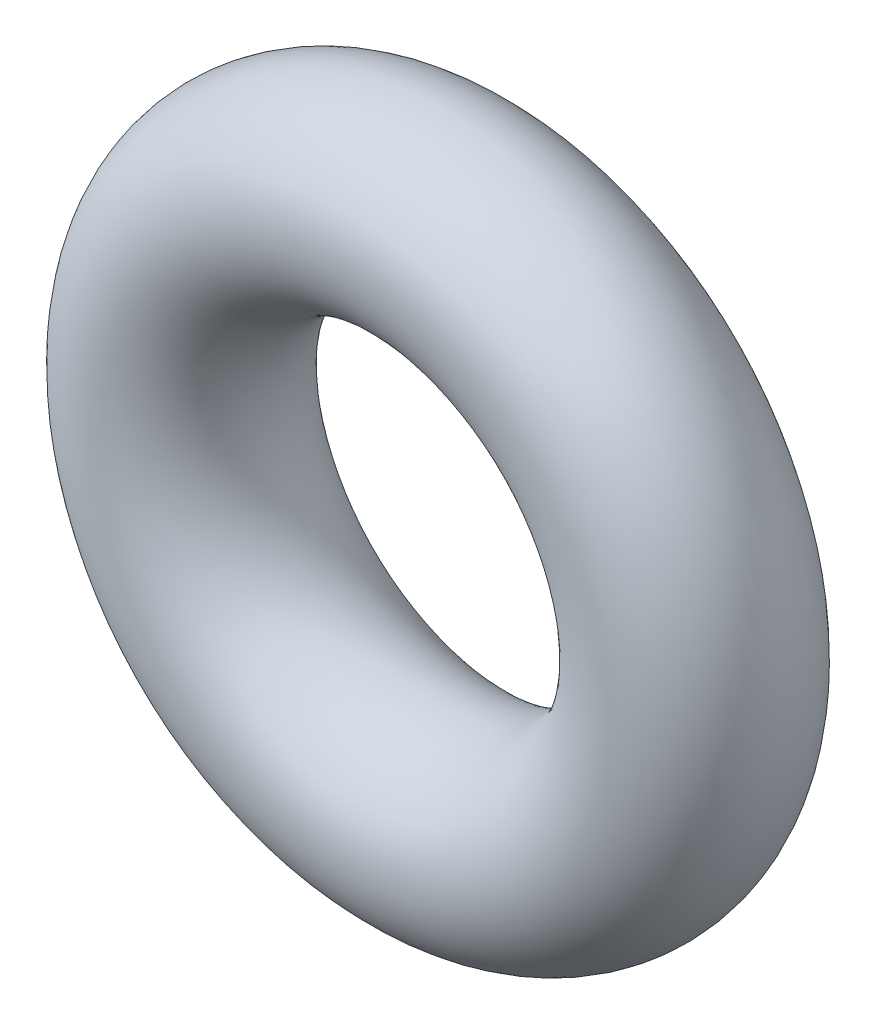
from build123d import *

# Parameters (mm, degrees)
SKETCH2_R = 1.3081


with BuildPart() as part:
    # Sketch2 → Revolve1 (revolve)
    with BuildSketch(Plane(origin=(0, 0, 0), x_dir=(0, 0, -1), z_dir=(1, 0, 0)), mode=Mode.PRIVATE) as revolve1_sk:
        with Locations((0, 3.5179)):
            Circle(SKETCH2_R)
    revolve(revolve1_sk.sketch.rotate(Axis((0, 0, 11.250602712), (0, 0, -1)), 90), axis=Axis((0, 0, 11.250602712), (0, 0, -1)))


solid = part.part
